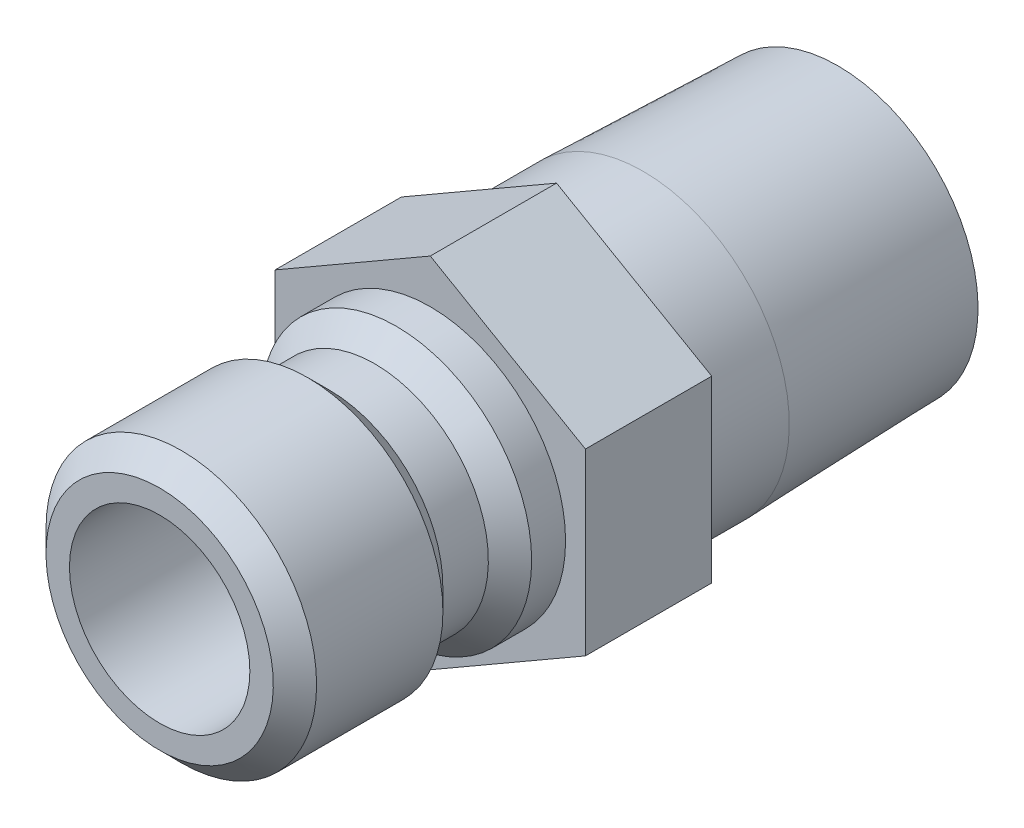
from build123d import *

# Parameters (mm, degrees)
SKETCH2_R           = 3.175
BOSS_EXTRUDE1_DEPTH = 4.445


with BuildPart() as part:
    # Sketch1 → Revolve1 (revolve)
    with BuildSketch(Plane(origin=(0, 0, 0), x_dir=(0, 0, -1), z_dir=(1, 0, 0))):
        Polygon((-9.525, 3.175), (-9.525, 4.0005), (-8.763, 4.7625), (-4.318, 4.7625), (-3.556, 4.0005), (-1.9558, 4.0005), (-1.1938, 4.7625), (0, 4.7625), (0, 5.1435), (7.493, 5.1435), (14.351, 4.929188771), (14.351, 2.9464), (0.127, 2.9464), (0.127, 3.175), align=None)
    revolve(axis=Axis((0, 0, 0), (0, 0, 1)))

    # Sketch2 → Boss-Extrude1 (add)
    with BuildSketch(Plane.XY):
        Polygon((-5.461, 3.15290982), (-5.461, -3.15290982), (0, -6.30581964), (5.461, -3.15290982), (5.461, 3.15290982), (0, 6.30581964), align=None)
        with Locations(Location((0, 0, 0), (0, 0, 90))):
            Circle(SKETCH2_R, mode=Mode.SUBTRACT)
    extrude(amount=-BOSS_EXTRUDE1_DEPTH)


solid = part.part
